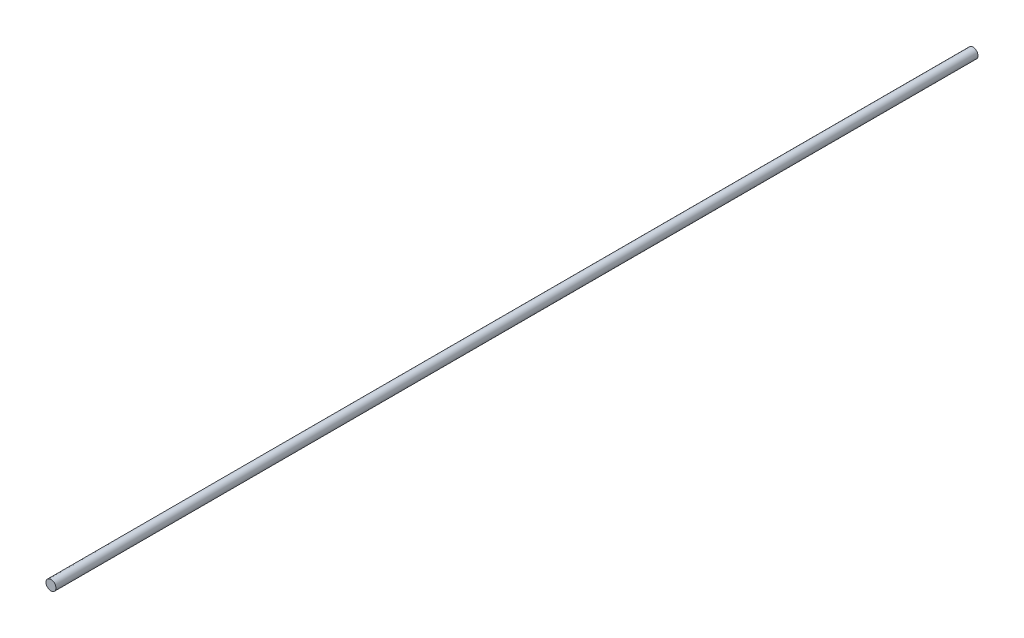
from build123d import *

# Parameters (mm, degrees)
ESQUISSE1_R      = 1.35
EXTRUSION1_DEPTH = 250


with BuildPart() as part:
    # Esquisse1 → Extrusion1 (new body)
    with BuildSketch(Plane.XY):
        Circle(ESQUISSE1_R)
    extrude(amount=EXTRUSION1_DEPTH)


solid = part.part
